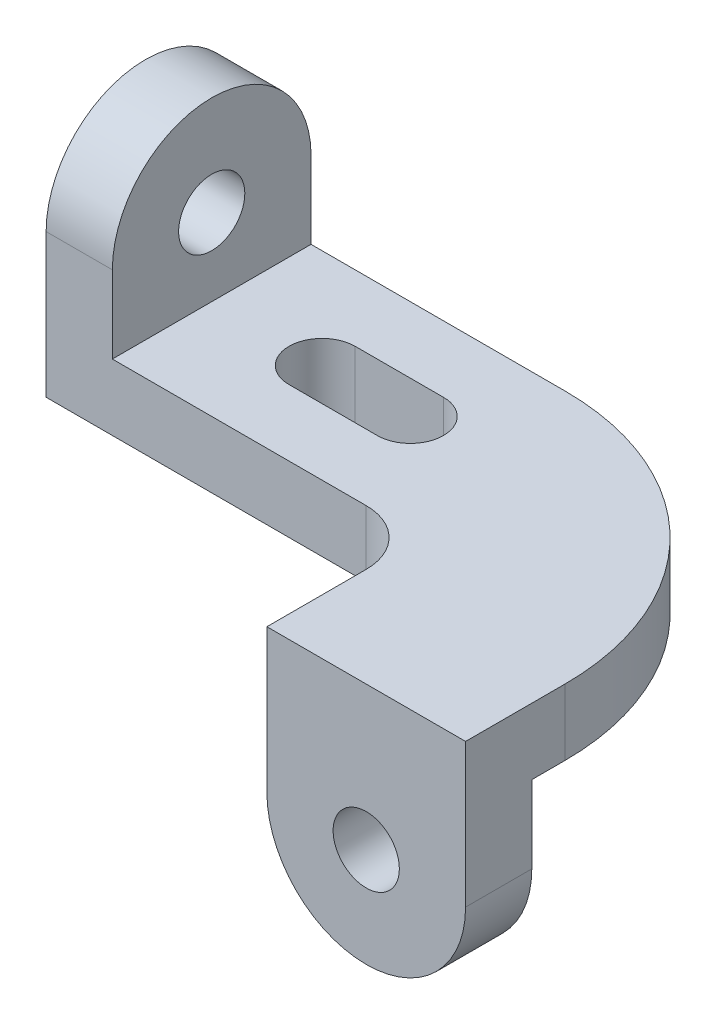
ISO-10303-21;
HEADER;
FILE_DESCRIPTION(('STEP AP214'),'2;1');
FILE_NAME('part.step','',(''),(''),'','','');
FILE_SCHEMA(('AUTOMOTIVE_DESIGN { 1 0 10303 214 1 1 1 1 }'));
ENDSEC;
DATA;
#1=APPLICATION_CONTEXT('core data for automotive mechanical design processes');
#2=APPLICATION_PROTOCOL_DEFINITION('international standard','automotive_design',2000,#1);
#3=PRODUCT_CONTEXT('',#1,'mechanical');
#4=PRODUCT('Part','Part','',(#3));
#5=PRODUCT_RELATED_PRODUCT_CATEGORY('part','',(#4));
#6=PRODUCT_DEFINITION_FORMATION('','',#4);
#7=PRODUCT_DEFINITION_CONTEXT('part definition',#1,'design');
#8=PRODUCT_DEFINITION('design','',#6,#7);
#9=PRODUCT_DEFINITION_SHAPE('','',#8);
#10=(LENGTH_UNIT() NAMED_UNIT(*) SI_UNIT(.MILLI.,.METRE.));
#11=(NAMED_UNIT(*) PLANE_ANGLE_UNIT() SI_UNIT($,.RADIAN.));
#12=(NAMED_UNIT(*) SI_UNIT($,.STERADIAN.) SOLID_ANGLE_UNIT());
#13=UNCERTAINTY_MEASURE_WITH_UNIT(LENGTH_MEASURE(1.E-05),#10,'distance_accuracy_value','');
#14=(GEOMETRIC_REPRESENTATION_CONTEXT(3) GLOBAL_UNCERTAINTY_ASSIGNED_CONTEXT((#13)) GLOBAL_UNIT_ASSIGNED_CONTEXT((#10,
#11,#12)) REPRESENTATION_CONTEXT('',''));
#15=CARTESIAN_POINT('',(0.,0.,0.));
#16=DIRECTION('',(0.,0.,1.));
#17=DIRECTION('',(1.,0.,0.));
#18=AXIS2_PLACEMENT_3D('',#15,#16,#17);
#19=CARTESIAN_POINT('',(92.075,0.,15.875));
#20=DIRECTION('',(0.,1.,0.));
#21=DIRECTION('',(0.,0.,1.));
#22=AXIS2_PLACEMENT_3D('',#19,#20,#21);
#23=PLANE('',#22);
#24=DIRECTION('',(-1.,0.,0.));
#25=VECTOR('',#24,1.);
#26=CARTESIAN_POINT('',(92.075,0.,-19.05));
#27=LINE('',#26,#25);
#28=CARTESIAN_POINT('',(76.1999999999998,0.,-19.05));
#29=VERTEX_POINT('',#28);
#30=CARTESIAN_POINT('',(50.7999999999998,0.,-19.05));
#31=VERTEX_POINT('',#30);
#32=EDGE_CURVE('E178',#29,#31,#27,.T.);
#33=ORIENTED_EDGE('',*,*,#32,.F.);
#34=CARTESIAN_POINT('',(76.1999999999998,0.,-28.575));
#35=DIRECTION('',(0.,1.,0.));
#36=DIRECTION('',(0.,0.,1.));
#37=AXIS2_PLACEMENT_3D('',#34,#35,#36);
#38=CIRCLE('',#37,9.52499999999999);
#39=CARTESIAN_POINT('',(76.1999999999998,0.,-38.1));
#40=VERTEX_POINT('',#39);
#41=EDGE_CURVE('E180',#29,#40,#38,.T.);
#42=ORIENTED_EDGE('',*,*,#41,.T.);
#43=DIRECTION('',(1.,0.,0.));
#44=VECTOR('',#43,1.);
#45=CARTESIAN_POINT('',(92.075,0.,-38.1));
#46=LINE('',#45,#44);
#47=CARTESIAN_POINT('',(50.7999999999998,0.,-38.1));
#48=VERTEX_POINT('',#47);
#49=EDGE_CURVE('E173',#48,#40,#46,.T.);
#50=ORIENTED_EDGE('',*,*,#49,.F.);
#51=CARTESIAN_POINT('',(50.7999999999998,0.,-28.575));
#52=DIRECTION('',(0.,1.,0.));
#53=DIRECTION('',(0.,0.,1.));
#54=AXIS2_PLACEMENT_3D('',#51,#52,#53);
#55=CIRCLE('',#54,9.52499999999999);
#56=EDGE_CURVE('E153',#31,#48,#55,.F.);
#57=ORIENTED_EDGE('',*,*,#56,.F.);
#58=EDGE_LOOP('',(#33,#42,#50,#57));
#59=FACE_BOUND('',#58,.T.);
#60=CARTESIAN_POINT('',(92.075,0.,15.875));
#61=DIRECTION('',(0.,-1.,0.));
#62=DIRECTION('',(0.,0.,1.));
#63=AXIS2_PLACEMENT_3D('',#60,#61,#62);
#64=CIRCLE('',#63,15.875);
#65=CARTESIAN_POINT('',(92.075,0.,0.));
#66=VERTEX_POINT('',#65);
#67=CARTESIAN_POINT('',(107.95,0.,15.875));
#68=VERTEX_POINT('',#67);
#69=EDGE_CURVE('E244',#66,#68,#64,.T.);
#70=ORIENTED_EDGE('',*,*,#69,.F.);
#71=DIRECTION('',(1.,0.,0.));
#72=VECTOR('',#71,1.);
#73=CARTESIAN_POINT('',(0.,0.,0.));
#74=LINE('',#73,#72);
#75=CARTESIAN_POINT('',(0.,0.,0.));
#76=VERTEX_POINT('',#75);
#77=EDGE_CURVE('E242',#76,#66,#74,.T.);
#78=ORIENTED_EDGE('',*,*,#77,.F.);
#79=DIRECTION('',(0.,0.,1.));
#80=VECTOR('',#79,1.);
#81=CARTESIAN_POINT('',(0.,0.,-57.15));
#82=LINE('',#81,#80);
#83=CARTESIAN_POINT('',(0.,0.,-57.15));
#84=VERTEX_POINT('',#83);
#85=EDGE_CURVE('E221',#84,#76,#82,.T.);
#86=ORIENTED_EDGE('',*,*,#85,.F.);
#87=DIRECTION('',(-1.,0.,0.));
#88=VECTOR('',#87,1.);
#89=CARTESIAN_POINT('',(92.075,0.,-57.15));
#90=LINE('',#89,#88);
#91=CARTESIAN_POINT('',(92.075,0.,-57.15));
#92=VERTEX_POINT('',#91);
#93=EDGE_CURVE('E227',#92,#84,#90,.T.);
#94=ORIENTED_EDGE('',*,*,#93,.F.);
#95=CARTESIAN_POINT('',(92.075,0.,15.875));
#96=DIRECTION('',(0.,1.,0.));
#97=DIRECTION('',(0.,0.,1.));
#98=AXIS2_PLACEMENT_3D('',#95,#96,#97);
#99=CIRCLE('',#98,73.025);
#100=CARTESIAN_POINT('',(165.1,0.,15.875));
#101=VERTEX_POINT('',#100);
#102=EDGE_CURVE('E251',#101,#92,#99,.T.);
#103=ORIENTED_EDGE('',*,*,#102,.F.);
#104=DIRECTION('',(0.,0.,-1.));
#105=VECTOR('',#104,1.);
#106=CARTESIAN_POINT('',(165.1,0.,44.45));
#107=LINE('',#106,#105);
#108=CARTESIAN_POINT('',(165.1,0.,25.4));
#109=VERTEX_POINT('',#108);
#110=EDGE_CURVE('E249',#109,#101,#107,.T.);
#111=ORIENTED_EDGE('',*,*,#110,.F.);
#112=DIRECTION('',(1.,0.,0.));
#113=VECTOR('',#112,1.);
#114=CARTESIAN_POINT('',(92.075,0.,25.4));
#115=LINE('',#114,#113);
#116=CARTESIAN_POINT('',(107.95,0.,25.4));
#117=VERTEX_POINT('',#116);
#118=EDGE_CURVE('E41',#117,#109,#115,.T.);
#119=ORIENTED_EDGE('',*,*,#118,.F.);
#120=DIRECTION('',(0.,0.,1.));
#121=VECTOR('',#120,1.);
#122=CARTESIAN_POINT('',(107.95,0.,15.875));
#123=LINE('',#122,#121);
#124=EDGE_CURVE('E246',#68,#117,#123,.T.);
#125=ORIENTED_EDGE('',*,*,#124,.F.);
#126=EDGE_LOOP('',(#70,#78,#86,#94,#103,#111,#119,#125));
#127=FACE_BOUND('',#126,.T.);
#128=ADVANCED_FACE('F32',(#59,#127),#23,.F.);
#129=CARTESIAN_POINT('',(0.,19.05,-57.15));
#130=DIRECTION('',(1.,0.,0.));
#131=DIRECTION('',(0.,0.,-1.));
#132=AXIS2_PLACEMENT_3D('',#129,#130,#131);
#133=PLANE('',#132);
#134=CARTESIAN_POINT('',(5.68434195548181E-11,41.275,-28.575));
#135=DIRECTION('',(-1.,0.,0.));
#136=DIRECTION('',(0.,0.,1.));
#137=AXIS2_PLACEMENT_3D('',#134,#135,#136);
#138=CIRCLE('',#137,9.525);
#139=CARTESIAN_POINT('',(5.68434185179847E-11,41.275,-19.05));
#140=VERTEX_POINT('',#139);
#141=EDGE_CURVE('E183',#140,#140,#138,.T.);
#142=ORIENTED_EDGE('',*,*,#141,.F.);
#143=EDGE_LOOP('',(#142));
#144=FACE_BOUND('',#143,.T.);
#145=ORIENTED_EDGE('',*,*,#85,.T.);
#146=DIRECTION('',(0.,-1.,0.));
#147=VECTOR('',#146,1.);
#148=CARTESIAN_POINT('',(0.,19.05,0.));
#149=LINE('',#148,#147);
#150=CARTESIAN_POINT('',(-3.53698556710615E-13,41.275,0.));
#151=VERTEX_POINT('',#150);
#152=EDGE_CURVE('E272',#151,#76,#149,.T.);
#153=ORIENTED_EDGE('',*,*,#152,.F.);
#154=CARTESIAN_POINT('',(-3.53695446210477E-13,41.275,-28.575));
#155=DIRECTION('',(1.,0.,0.));
#156=DIRECTION('',(0.,0.,-1.));
#157=AXIS2_PLACEMENT_3D('',#154,#155,#156);
#158=CIRCLE('',#157,28.575);
#159=CARTESIAN_POINT('',(-3.53692335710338E-13,41.275,-57.15));
#160=VERTEX_POINT('',#159);
#161=EDGE_CURVE('E193',#160,#151,#158,.T.);
#162=ORIENTED_EDGE('',*,*,#161,.F.);
#163=DIRECTION('',(0.,-1.,0.));
#164=VECTOR('',#163,1.);
#165=CARTESIAN_POINT('',(0.,19.05,-57.15));
#166=LINE('',#165,#164);
#167=EDGE_CURVE('E239',#160,#84,#166,.T.);
#168=ORIENTED_EDGE('',*,*,#167,.T.);
#169=EDGE_LOOP('',(#145,#153,#162,#168));
#170=FACE_BOUND('',#169,.T.);
#171=ADVANCED_FACE('F34',(#144,#170),#133,.F.);
#172=CARTESIAN_POINT('',(0.,19.05,0.));
#173=DIRECTION('',(0.,0.,-1.));
#174=DIRECTION('',(-1.,0.,0.));
#175=AXIS2_PLACEMENT_3D('',#172,#173,#174);
#176=PLANE('',#175);
#177=DIRECTION('',(1.,0.,0.));
#178=VECTOR('',#177,1.);
#179=CARTESIAN_POINT('',(0.,19.05,0.));
#180=LINE('',#179,#178);
#181=CARTESIAN_POINT('',(19.0499999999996,19.05,0.));
#182=VERTEX_POINT('',#181);
#183=CARTESIAN_POINT('',(92.075,19.05,0.));
#184=VERTEX_POINT('',#183);
#185=EDGE_CURVE('E224',#182,#184,#180,.T.);
#186=ORIENTED_EDGE('',*,*,#185,.F.);
#187=DIRECTION('',(0.,-1.,0.));
#188=VECTOR('',#187,1.);
#189=CARTESIAN_POINT('',(19.0499999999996,0.,0.));
#190=LINE('',#189,#188);
#191=CARTESIAN_POINT('',(19.0499999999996,41.275,0.));
#192=VERTEX_POINT('',#191);
#193=EDGE_CURVE('E195',#192,#182,#190,.T.);
#194=ORIENTED_EDGE('',*,*,#193,.F.);
#195=DIRECTION('',(-1.,0.,0.));
#196=VECTOR('',#195,1.);
#197=CARTESIAN_POINT('',(19.0499999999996,41.275,0.));
#198=LINE('',#197,#196);
#199=EDGE_CURVE('E198',#192,#151,#198,.T.);
#200=ORIENTED_EDGE('',*,*,#199,.T.);
#201=ORIENTED_EDGE('',*,*,#152,.T.);
#202=ORIENTED_EDGE('',*,*,#77,.T.);
#203=DIRECTION('',(0.,-1.,0.));
#204=VECTOR('',#203,1.);
#205=CARTESIAN_POINT('',(92.075,19.05,0.));
#206=LINE('',#205,#204);
#207=EDGE_CURVE('E269',#184,#66,#206,.T.);
#208=ORIENTED_EDGE('',*,*,#207,.F.);
#209=EDGE_LOOP('',(#186,#194,#200,#201,#202,#208));
#210=FACE_BOUND('',#209,.T.);
#211=ADVANCED_FACE('F303',(#210),#176,.F.);
#212=CARTESIAN_POINT('',(92.075,19.05,15.875));
#213=DIRECTION('',(0.,-1.,0.));
#214=DIRECTION('',(0.,0.,-1.));
#215=AXIS2_PLACEMENT_3D('',#212,#213,#214);
#216=CYLINDRICAL_SURFACE('',#215,15.875);
#217=ORIENTED_EDGE('',*,*,#69,.T.);
#218=DIRECTION('',(0.,-1.,0.));
#219=VECTOR('',#218,1.);
#220=CARTESIAN_POINT('',(107.95,19.05,15.875));
#221=LINE('',#220,#219);
#222=CARTESIAN_POINT('',(107.95,19.05,15.875));
#223=VERTEX_POINT('',#222);
#224=EDGE_CURVE('E266',#223,#68,#221,.T.);
#225=ORIENTED_EDGE('',*,*,#224,.F.);
#226=CARTESIAN_POINT('',(92.075,19.05,15.875));
#227=DIRECTION('',(0.,-1.,0.));
#228=DIRECTION('',(0.,0.,1.));
#229=AXIS2_PLACEMENT_3D('',#226,#227,#228);
#230=CIRCLE('',#229,15.875);
#231=EDGE_CURVE('E226',#184,#223,#230,.T.);
#232=ORIENTED_EDGE('',*,*,#231,.F.);
#233=ORIENTED_EDGE('',*,*,#207,.T.);
#234=EDGE_LOOP('',(#217,#225,#232,#233));
#235=FACE_BOUND('',#234,.T.);
#236=ADVANCED_FACE('F329',(#235),#216,.F.);
#237=CARTESIAN_POINT('',(107.95,19.05,15.875));
#238=DIRECTION('',(1.,0.,0.));
#239=DIRECTION('',(0.,0.,-1.));
#240=AXIS2_PLACEMENT_3D('',#237,#238,#239);
#241=PLANE('',#240);
#242=DIRECTION('',(0.,-1.,0.));
#243=VECTOR('',#242,1.);
#244=CARTESIAN_POINT('',(107.95,19.05,44.45));
#245=LINE('',#244,#243);
#246=CARTESIAN_POINT('',(107.95,19.05,44.45));
#247=VERTEX_POINT('',#246);
#248=CARTESIAN_POINT('',(107.95,-22.225,44.45));
#249=VERTEX_POINT('',#248);
#250=EDGE_CURVE('E264',#247,#249,#245,.T.);
#251=ORIENTED_EDGE('',*,*,#250,.F.);
#252=DIRECTION('',(0.,0.,1.));
#253=VECTOR('',#252,1.);
#254=CARTESIAN_POINT('',(107.95,19.05,15.875));
#255=LINE('',#254,#253);
#256=EDGE_CURVE('E229',#223,#247,#255,.T.);
#257=ORIENTED_EDGE('',*,*,#256,.F.);
#258=ORIENTED_EDGE('',*,*,#224,.T.);
#259=ORIENTED_EDGE('',*,*,#124,.T.);
#260=DIRECTION('',(0.,-1.,0.));
#261=VECTOR('',#260,1.);
#262=CARTESIAN_POINT('',(107.95,19.05,25.4));
#263=LINE('',#262,#261);
#264=CARTESIAN_POINT('',(107.95,-22.225,25.4));
#265=VERTEX_POINT('',#264);
#266=EDGE_CURVE('E207',#117,#265,#263,.T.);
#267=ORIENTED_EDGE('',*,*,#266,.T.);
#268=DIRECTION('',(0.,0.,1.));
#269=VECTOR('',#268,1.);
#270=CARTESIAN_POINT('',(107.95,-22.225,25.4));
#271=LINE('',#270,#269);
#272=EDGE_CURVE('E215',#265,#249,#271,.T.);
#273=ORIENTED_EDGE('',*,*,#272,.T.);
#274=EDGE_LOOP('',(#251,#257,#258,#259,#267,#273));
#275=FACE_BOUND('',#274,.T.);
#276=ADVANCED_FACE('F325',(#275),#241,.F.);
#277=CARTESIAN_POINT('',(107.95,19.05,44.45));
#278=DIRECTION('',(0.,0.,-1.));
#279=DIRECTION('',(-1.,0.,0.));
#280=AXIS2_PLACEMENT_3D('',#277,#278,#279);
#281=PLANE('',#280);
#282=CARTESIAN_POINT('',(136.525,-22.225,44.45));
#283=DIRECTION('',(0.,0.,1.));
#284=DIRECTION('',(1.,0.,0.));
#285=AXIS2_PLACEMENT_3D('',#282,#283,#284);
#286=CIRCLE('',#285,9.525);
#287=CARTESIAN_POINT('',(146.05,-22.225,44.45));
#288=VERTEX_POINT('',#287);
#289=EDGE_CURVE('E186',#288,#288,#286,.T.);
#290=ORIENTED_EDGE('',*,*,#289,.F.);
#291=EDGE_LOOP('',(#290));
#292=FACE_BOUND('',#291,.T.);
#293=ORIENTED_EDGE('',*,*,#250,.T.);
#294=CARTESIAN_POINT('',(136.525,-22.225,44.45));
#295=DIRECTION('',(0.,0.,1.));
#296=DIRECTION('',(1.,0.,0.));
#297=AXIS2_PLACEMENT_3D('',#294,#295,#296);
#298=CIRCLE('',#297,28.575);
#299=CARTESIAN_POINT('',(165.1,-22.225,44.45));
#300=VERTEX_POINT('',#299);
#301=EDGE_CURVE('E206',#249,#300,#298,.T.);
#302=ORIENTED_EDGE('',*,*,#301,.T.);
#303=DIRECTION('',(0.,-1.,0.));
#304=VECTOR('',#303,1.);
#305=CARTESIAN_POINT('',(165.1,19.05,44.45));
#306=LINE('',#305,#304);
#307=CARTESIAN_POINT('',(165.1,19.05,44.45));
#308=VERTEX_POINT('',#307);
#309=EDGE_CURVE('E262',#308,#300,#306,.T.);
#310=ORIENTED_EDGE('',*,*,#309,.F.);
#311=DIRECTION('',(1.,0.,0.));
#312=VECTOR('',#311,1.);
#313=CARTESIAN_POINT('',(107.95,19.05,44.45));
#314=LINE('',#313,#312);
#315=EDGE_CURVE('E231',#247,#308,#314,.T.);
#316=ORIENTED_EDGE('',*,*,#315,.F.);
#317=EDGE_LOOP('',(#293,#302,#310,#316));
#318=FACE_BOUND('',#317,.T.);
#319=ADVANCED_FACE('F321',(#292,#318),#281,.F.);
#320=CARTESIAN_POINT('',(165.1,19.05,44.45));
#321=DIRECTION('',(-1.,0.,0.));
#322=DIRECTION('',(0.,0.,1.));
#323=AXIS2_PLACEMENT_3D('',#320,#321,#322);
#324=PLANE('',#323);
#325=ORIENTED_EDGE('',*,*,#309,.T.);
#326=DIRECTION('',(0.,0.,1.));
#327=VECTOR('',#326,1.);
#328=CARTESIAN_POINT('',(165.1,-22.225,25.4));
#329=LINE('',#328,#327);
#330=CARTESIAN_POINT('',(165.1,-22.225,25.4));
#331=VERTEX_POINT('',#330);
#332=EDGE_CURVE('E218',#331,#300,#329,.T.);
#333=ORIENTED_EDGE('',*,*,#332,.F.);
#334=DIRECTION('',(0.,1.,0.));
#335=VECTOR('',#334,1.);
#336=CARTESIAN_POINT('',(165.1,19.05,25.4));
#337=LINE('',#336,#335);
#338=EDGE_CURVE('E212',#331,#109,#337,.T.);
#339=ORIENTED_EDGE('',*,*,#338,.T.);
#340=ORIENTED_EDGE('',*,*,#110,.T.);
#341=DIRECTION('',(0.,-1.,0.));
#342=VECTOR('',#341,1.);
#343=CARTESIAN_POINT('',(165.1,19.05,15.875));
#344=LINE('',#343,#342);
#345=CARTESIAN_POINT('',(165.1,19.05,15.875));
#346=VERTEX_POINT('',#345);
#347=EDGE_CURVE('E259',#346,#101,#344,.T.);
#348=ORIENTED_EDGE('',*,*,#347,.F.);
#349=DIRECTION('',(0.,0.,-1.));
#350=VECTOR('',#349,1.);
#351=CARTESIAN_POINT('',(165.1,19.05,44.45));
#352=LINE('',#351,#350);
#353=EDGE_CURVE('E233',#308,#346,#352,.T.);
#354=ORIENTED_EDGE('',*,*,#353,.F.);
#355=EDGE_LOOP('',(#325,#333,#339,#340,#348,#354));
#356=FACE_BOUND('',#355,.T.);
#357=ADVANCED_FACE('F317',(#356),#324,.F.);
#358=CARTESIAN_POINT('',(92.075,19.05,15.875));
#359=DIRECTION('',(0.,-1.,0.));
#360=DIRECTION('',(0.,0.,-1.));
#361=AXIS2_PLACEMENT_3D('',#358,#359,#360);
#362=CYLINDRICAL_SURFACE('',#361,73.025);
#363=ORIENTED_EDGE('',*,*,#102,.T.);
#364=DIRECTION('',(0.,-1.,0.));
#365=VECTOR('',#364,1.);
#366=CARTESIAN_POINT('',(92.075,19.05,-57.15));
#367=LINE('',#366,#365);
#368=CARTESIAN_POINT('',(92.075,19.05,-57.15));
#369=VERTEX_POINT('',#368);
#370=EDGE_CURVE('E256',#369,#92,#367,.T.);
#371=ORIENTED_EDGE('',*,*,#370,.F.);
#372=CARTESIAN_POINT('',(92.075,19.05,15.875));
#373=DIRECTION('',(0.,1.,0.));
#374=DIRECTION('',(0.,0.,1.));
#375=AXIS2_PLACEMENT_3D('',#372,#373,#374);
#376=CIRCLE('',#375,73.025);
#377=EDGE_CURVE('E235',#346,#369,#376,.T.);
#378=ORIENTED_EDGE('',*,*,#377,.F.);
#379=ORIENTED_EDGE('',*,*,#347,.T.);
#380=EDGE_LOOP('',(#363,#371,#378,#379));
#381=FACE_BOUND('',#380,.T.);
#382=ADVANCED_FACE('F313',(#381),#362,.T.);
#383=CARTESIAN_POINT('',(92.075,19.05,-57.15));
#384=DIRECTION('',(0.,0.,1.));
#385=DIRECTION('',(1.,0.,0.));
#386=AXIS2_PLACEMENT_3D('',#383,#384,#385);
#387=PLANE('',#386);
#388=ORIENTED_EDGE('',*,*,#93,.T.);
#389=ORIENTED_EDGE('',*,*,#167,.F.);
#390=DIRECTION('',(-1.,0.,0.));
#391=VECTOR('',#390,1.);
#392=CARTESIAN_POINT('',(19.0499999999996,41.275,-57.15));
#393=LINE('',#392,#391);
#394=CARTESIAN_POINT('',(19.0499999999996,41.275,-57.15));
#395=VERTEX_POINT('',#394);
#396=EDGE_CURVE('E203',#395,#160,#393,.T.);
#397=ORIENTED_EDGE('',*,*,#396,.F.);
#398=DIRECTION('',(0.,1.,0.));
#399=VECTOR('',#398,1.);
#400=CARTESIAN_POINT('',(19.0499999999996,0.,-57.15));
#401=LINE('',#400,#399);
#402=CARTESIAN_POINT('',(19.0499999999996,19.05,-57.15));
#403=VERTEX_POINT('',#402);
#404=EDGE_CURVE('E190',#403,#395,#401,.T.);
#405=ORIENTED_EDGE('',*,*,#404,.F.);
#406=DIRECTION('',(-1.,0.,0.));
#407=VECTOR('',#406,1.);
#408=CARTESIAN_POINT('',(92.075,19.05,-57.15));
#409=LINE('',#408,#407);
#410=EDGE_CURVE('E237',#369,#403,#409,.T.);
#411=ORIENTED_EDGE('',*,*,#410,.F.);
#412=ORIENTED_EDGE('',*,*,#370,.T.);
#413=EDGE_LOOP('',(#388,#389,#397,#405,#411,#412));
#414=FACE_BOUND('',#413,.T.);
#415=ADVANCED_FACE('F310',(#414),#387,.F.);
#416=CARTESIAN_POINT('',(92.075,19.05,15.875));
#417=DIRECTION('',(0.,1.,0.));
#418=DIRECTION('',(0.,0.,1.));
#419=AXIS2_PLACEMENT_3D('',#416,#417,#418);
#420=PLANE('',#419);
#421=CARTESIAN_POINT('',(76.1999999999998,19.0499999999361,-28.575));
#422=DIRECTION('',(0.,1.,0.));
#423=DIRECTION('',(0.,0.,1.));
#424=AXIS2_PLACEMENT_3D('',#421,#422,#423);
#425=CIRCLE('',#424,9.52499999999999);
#426=CARTESIAN_POINT('',(76.1999999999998,19.0499999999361,-19.05));
#427=VERTEX_POINT('',#426);
#428=CARTESIAN_POINT('',(76.1999999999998,19.05,-38.1));
#429=VERTEX_POINT('',#428);
#430=EDGE_CURVE('E57',#427,#429,#425,.T.);
#431=ORIENTED_EDGE('',*,*,#430,.F.);
#432=DIRECTION('',(-1.,0.,0.));
#433=VECTOR('',#432,1.);
#434=CARTESIAN_POINT('',(76.1999999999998,19.0499999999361,-19.05));
#435=LINE('',#434,#433);
#436=CARTESIAN_POINT('',(50.7999999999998,19.0499999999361,-19.05));
#437=VERTEX_POINT('',#436);
#438=EDGE_CURVE('E166',#427,#437,#435,.T.);
#439=ORIENTED_EDGE('',*,*,#438,.T.);
#440=CARTESIAN_POINT('',(50.7999999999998,19.0499999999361,-28.575));
#441=DIRECTION('',(0.,-1.,0.));
#442=DIRECTION('',(0.,0.,-1.));
#443=AXIS2_PLACEMENT_3D('',#440,#441,#442);
#444=CIRCLE('',#443,9.52499999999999);
#445=CARTESIAN_POINT('',(50.7999999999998,19.0499999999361,-38.1));
#446=VERTEX_POINT('',#445);
#447=EDGE_CURVE('E150',#437,#446,#444,.T.);
#448=ORIENTED_EDGE('',*,*,#447,.T.);
#449=DIRECTION('',(1.,0.,0.));
#450=VECTOR('',#449,1.);
#451=CARTESIAN_POINT('',(50.7999999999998,19.0499999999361,-38.1));
#452=LINE('',#451,#450);
#453=EDGE_CURVE('E159',#446,#429,#452,.T.);
#454=ORIENTED_EDGE('',*,*,#453,.T.);
#455=EDGE_LOOP('',(#431,#439,#448,#454));
#456=FACE_BOUND('',#455,.T.);
#457=DIRECTION('',(0.,0.,-1.));
#458=VECTOR('',#457,1.);
#459=CARTESIAN_POINT('',(19.0499999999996,19.05,15.875));
#460=LINE('',#459,#458);
#461=EDGE_CURVE('E11',#182,#403,#460,.T.);
#462=ORIENTED_EDGE('',*,*,#461,.F.);
#463=ORIENTED_EDGE('',*,*,#185,.T.);
#464=ORIENTED_EDGE('',*,*,#231,.T.);
#465=ORIENTED_EDGE('',*,*,#256,.T.);
#466=ORIENTED_EDGE('',*,*,#315,.T.);
#467=ORIENTED_EDGE('',*,*,#353,.T.);
#468=ORIENTED_EDGE('',*,*,#377,.T.);
#469=ORIENTED_EDGE('',*,*,#410,.T.);
#470=EDGE_LOOP('',(#462,#463,#464,#465,#466,#467,#468,#469));
#471=FACE_BOUND('',#470,.T.);
#472=ADVANCED_FACE('F163',(#456,#471),#420,.T.);
#473=CARTESIAN_POINT('',(136.525,-22.225,25.4));
#474=DIRECTION('',(0.,0.,1.));
#475=DIRECTION('',(1.,0.,0.));
#476=AXIS2_PLACEMENT_3D('',#473,#474,#475);
#477=PLANE('',#476);
#478=CARTESIAN_POINT('',(136.525,-22.225,25.4));
#479=DIRECTION('',(0.,0.,1.));
#480=DIRECTION('',(1.,0.,0.));
#481=AXIS2_PLACEMENT_3D('',#478,#479,#480);
#482=CIRCLE('',#481,9.525);
#483=CARTESIAN_POINT('',(146.05,-22.225,25.4));
#484=VERTEX_POINT('',#483);
#485=EDGE_CURVE('E189',#484,#484,#482,.T.);
#486=ORIENTED_EDGE('',*,*,#485,.T.);
#487=EDGE_LOOP('',(#486));
#488=FACE_BOUND('',#487,.T.);
#489=ORIENTED_EDGE('',*,*,#266,.F.);
#490=ORIENTED_EDGE('',*,*,#118,.T.);
#491=ORIENTED_EDGE('',*,*,#338,.F.);
#492=CARTESIAN_POINT('',(136.525,-22.225,25.4));
#493=DIRECTION('',(0.,0.,1.));
#494=DIRECTION('',(1.,0.,0.));
#495=AXIS2_PLACEMENT_3D('',#492,#493,#494);
#496=CIRCLE('',#495,28.575);
#497=EDGE_CURVE('E209',#265,#331,#496,.T.);
#498=ORIENTED_EDGE('',*,*,#497,.F.);
#499=EDGE_LOOP('',(#489,#490,#491,#498));
#500=FACE_BOUND('',#499,.T.);
#501=ADVANCED_FACE('F278',(#488,#500),#477,.F.);
#502=CARTESIAN_POINT('',(136.525,-22.225,25.4));
#503=DIRECTION('',(0.,0.,1.));
#504=DIRECTION('',(1.,0.,0.));
#505=AXIS2_PLACEMENT_3D('',#502,#503,#504);
#506=CYLINDRICAL_SURFACE('',#505,28.575);
#507=ORIENTED_EDGE('',*,*,#301,.F.);
#508=ORIENTED_EDGE('',*,*,#272,.F.);
#509=ORIENTED_EDGE('',*,*,#497,.T.);
#510=ORIENTED_EDGE('',*,*,#332,.T.);
#511=EDGE_LOOP('',(#507,#508,#509,#510));
#512=FACE_BOUND('',#511,.T.);
#513=ADVANCED_FACE('F371',(#512),#506,.T.);
#514=CARTESIAN_POINT('',(19.0499999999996,41.275,-28.575));
#515=DIRECTION('',(-1.,0.,0.));
#516=DIRECTION('',(0.,0.,1.));
#517=AXIS2_PLACEMENT_3D('',#514,#515,#516);
#518=CYLINDRICAL_SURFACE('',#517,28.575);
#519=ORIENTED_EDGE('',*,*,#161,.T.);
#520=ORIENTED_EDGE('',*,*,#199,.F.);
#521=CARTESIAN_POINT('',(19.0499999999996,41.275,-28.575));
#522=DIRECTION('',(1.,0.,0.));
#523=DIRECTION('',(0.,0.,-1.));
#524=AXIS2_PLACEMENT_3D('',#521,#522,#523);
#525=CIRCLE('',#524,28.575);
#526=EDGE_CURVE('E192',#395,#192,#525,.T.);
#527=ORIENTED_EDGE('',*,*,#526,.F.);
#528=ORIENTED_EDGE('',*,*,#396,.T.);
#529=EDGE_LOOP('',(#519,#520,#527,#528));
#530=FACE_BOUND('',#529,.T.);
#531=ADVANCED_FACE('F294',(#530),#518,.T.);
#532=CARTESIAN_POINT('',(19.0499999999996,41.275,-28.575));
#533=DIRECTION('',(1.,0.,0.));
#534=DIRECTION('',(0.,0.,-1.));
#535=AXIS2_PLACEMENT_3D('',#532,#533,#534);
#536=PLANE('',#535);
#537=CARTESIAN_POINT('',(19.0499999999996,41.275,-28.575));
#538=DIRECTION('',(1.,0.,0.));
#539=DIRECTION('',(0.,0.,-1.));
#540=AXIS2_PLACEMENT_3D('',#537,#538,#539);
#541=CIRCLE('',#540,9.525);
#542=CARTESIAN_POINT('',(19.0499999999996,41.275,-38.1));
#543=VERTEX_POINT('',#542);
#544=EDGE_CURVE('E36',#543,#543,#541,.T.);
#545=ORIENTED_EDGE('',*,*,#544,.F.);
#546=EDGE_LOOP('',(#545));
#547=FACE_BOUND('',#546,.T.);
#548=ORIENTED_EDGE('',*,*,#193,.T.);
#549=ORIENTED_EDGE('',*,*,#461,.T.);
#550=ORIENTED_EDGE('',*,*,#404,.T.);
#551=ORIENTED_EDGE('',*,*,#526,.T.);
#552=EDGE_LOOP('',(#548,#549,#550,#551));
#553=FACE_BOUND('',#552,.T.);
#554=ADVANCED_FACE('F284',(#547,#553),#536,.T.);
#555=CARTESIAN_POINT('',(136.525,-22.225,-57.15));
#556=DIRECTION('',(0.,0.,1.));
#557=DIRECTION('',(1.,0.,0.));
#558=AXIS2_PLACEMENT_3D('',#555,#556,#557);
#559=CYLINDRICAL_SURFACE('',#558,9.525);
#560=ORIENTED_EDGE('',*,*,#289,.T.);
#561=EDGE_LOOP('',(#560));
#562=FACE_BOUND('',#561,.T.);
#563=ORIENTED_EDGE('',*,*,#485,.F.);
#564=EDGE_LOOP('',(#563));
#565=FACE_BOUND('',#564,.T.);
#566=ADVANCED_FACE('F281',(#562,#565),#559,.F.);
#567=CARTESIAN_POINT('',(165.1,41.275,-28.575));
#568=DIRECTION('',(-1.,0.,0.));
#569=DIRECTION('',(0.,0.,1.));
#570=AXIS2_PLACEMENT_3D('',#567,#568,#569);
#571=CYLINDRICAL_SURFACE('',#570,9.525);
#572=ORIENTED_EDGE('',*,*,#544,.T.);
#573=EDGE_LOOP('',(#572));
#574=FACE_BOUND('',#573,.T.);
#575=ORIENTED_EDGE('',*,*,#141,.T.);
#576=EDGE_LOOP('',(#575));
#577=FACE_BOUND('',#576,.T.);
#578=ADVANCED_FACE('F283',(#574,#577),#571,.F.);
#579=CARTESIAN_POINT('',(76.1999999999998,-50.8,-28.575));
#580=DIRECTION('',(0.,1.,0.));
#581=DIRECTION('',(0.,0.,1.));
#582=AXIS2_PLACEMENT_3D('',#579,#580,#581);
#583=CYLINDRICAL_SURFACE('',#582,9.52499999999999);
#584=DIRECTION('',(0.,1.,0.));
#585=VECTOR('',#584,1.);
#586=CARTESIAN_POINT('',(76.1999999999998,-50.8,-19.05));
#587=LINE('',#586,#585);
#588=EDGE_CURVE('E171',#29,#427,#587,.T.);
#589=ORIENTED_EDGE('',*,*,#588,.T.);
#590=ORIENTED_EDGE('',*,*,#430,.T.);
#591=DIRECTION('',(0.,1.,0.));
#592=VECTOR('',#591,1.);
#593=CARTESIAN_POINT('',(76.1999999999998,-50.8,-38.1));
#594=LINE('',#593,#592);
#595=EDGE_CURVE('E156',#40,#429,#594,.T.);
#596=ORIENTED_EDGE('',*,*,#595,.F.);
#597=ORIENTED_EDGE('',*,*,#41,.F.);
#598=EDGE_LOOP('',(#589,#590,#596,#597));
#599=FACE_BOUND('',#598,.T.);
#600=ADVANCED_FACE('F291',(#599),#583,.F.);
#601=CARTESIAN_POINT('',(76.1999999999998,-50.8,-19.05));
#602=DIRECTION('',(0.,0.,-1.));
#603=DIRECTION('',(-1.,0.,0.));
#604=AXIS2_PLACEMENT_3D('',#601,#602,#603);
#605=PLANE('',#604);
#606=ORIENTED_EDGE('',*,*,#32,.T.);
#607=DIRECTION('',(0.,1.,0.));
#608=VECTOR('',#607,1.);
#609=CARTESIAN_POINT('',(50.7999999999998,-50.8,-19.05));
#610=LINE('',#609,#608);
#611=EDGE_CURVE('E155',#31,#437,#610,.T.);
#612=ORIENTED_EDGE('',*,*,#611,.T.);
#613=ORIENTED_EDGE('',*,*,#438,.F.);
#614=ORIENTED_EDGE('',*,*,#588,.F.);
#615=EDGE_LOOP('',(#606,#612,#613,#614));
#616=FACE_BOUND('',#615,.T.);
#617=ADVANCED_FACE('F492',(#616),#605,.T.);
#618=CARTESIAN_POINT('',(50.7999999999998,-50.8,-28.575));
#619=DIRECTION('',(0.,1.,0.));
#620=DIRECTION('',(0.,0.,1.));
#621=AXIS2_PLACEMENT_3D('',#618,#619,#620);
#622=CYLINDRICAL_SURFACE('',#621,9.52499999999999);
#623=ORIENTED_EDGE('',*,*,#56,.T.);
#624=DIRECTION('',(0.,1.,0.));
#625=VECTOR('',#624,1.);
#626=CARTESIAN_POINT('',(50.7999999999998,-50.8,-38.1));
#627=LINE('',#626,#625);
#628=EDGE_CURVE('E49',#48,#446,#627,.T.);
#629=ORIENTED_EDGE('',*,*,#628,.T.);
#630=ORIENTED_EDGE('',*,*,#447,.F.);
#631=ORIENTED_EDGE('',*,*,#611,.F.);
#632=EDGE_LOOP('',(#623,#629,#630,#631));
#633=FACE_BOUND('',#632,.T.);
#634=ADVANCED_FACE('F147',(#633),#622,.F.);
#635=CARTESIAN_POINT('',(50.7999999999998,-50.8,-38.1));
#636=DIRECTION('',(0.,0.,1.));
#637=DIRECTION('',(1.,0.,0.));
#638=AXIS2_PLACEMENT_3D('',#635,#636,#637);
#639=PLANE('',#638);
#640=ORIENTED_EDGE('',*,*,#49,.T.);
#641=ORIENTED_EDGE('',*,*,#595,.T.);
#642=ORIENTED_EDGE('',*,*,#453,.F.);
#643=ORIENTED_EDGE('',*,*,#628,.F.);
#644=EDGE_LOOP('',(#640,#641,#642,#643));
#645=FACE_BOUND('',#644,.T.);
#646=ADVANCED_FACE('F160',(#645),#639,.T.);
#647=CLOSED_SHELL('',(#128,#171,#211,#236,#276,#319,#357,#382,#415,#472,#501,#513,#531,#554,
#566,#578,#600,#617,#634,#646));
#648=MANIFOLD_SOLID_BREP('B2',#647);
#649=ADVANCED_BREP_SHAPE_REPRESENTATION('',(#18,#648),#14);
#650=SHAPE_DEFINITION_REPRESENTATION(#9,#649);
ENDSEC;
END-ISO-10303-21;
